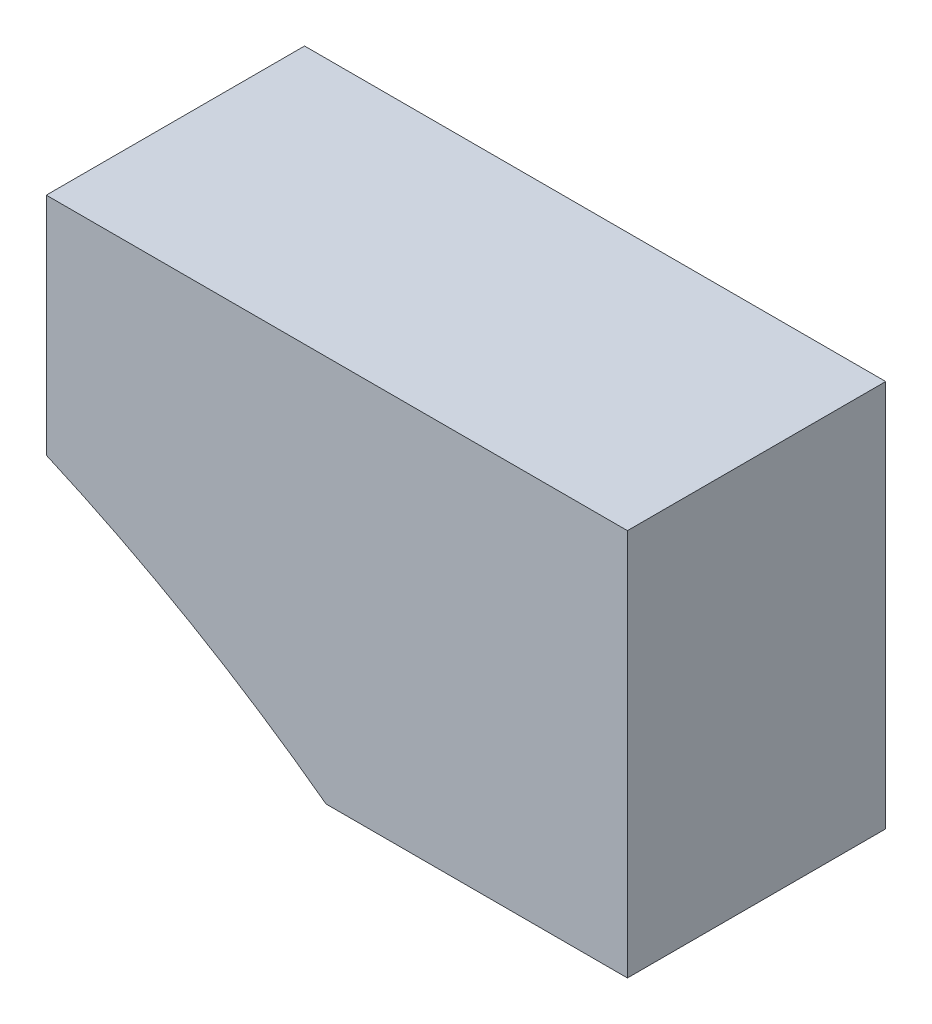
ISO-10303-21;
HEADER;
FILE_DESCRIPTION(('STEP AP214'),'2;1');
FILE_NAME('part.step','',(''),(''),'','','');
FILE_SCHEMA(('AUTOMOTIVE_DESIGN { 1 0 10303 214 1 1 1 1 }'));
ENDSEC;
DATA;
#1=APPLICATION_CONTEXT('core data for automotive mechanical design processes');
#2=APPLICATION_PROTOCOL_DEFINITION('international standard','automotive_design',2000,#1);
#3=PRODUCT_CONTEXT('',#1,'mechanical');
#4=PRODUCT('Part','Part','',(#3));
#5=PRODUCT_RELATED_PRODUCT_CATEGORY('part','',(#4));
#6=PRODUCT_DEFINITION_FORMATION('','',#4);
#7=PRODUCT_DEFINITION_CONTEXT('part definition',#1,'design');
#8=PRODUCT_DEFINITION('design','',#6,#7);
#9=PRODUCT_DEFINITION_SHAPE('','',#8);
#10=(LENGTH_UNIT() NAMED_UNIT(*) SI_UNIT(.MILLI.,.METRE.));
#11=(NAMED_UNIT(*) PLANE_ANGLE_UNIT() SI_UNIT($,.RADIAN.));
#12=(NAMED_UNIT(*) SI_UNIT($,.STERADIAN.) SOLID_ANGLE_UNIT());
#13=UNCERTAINTY_MEASURE_WITH_UNIT(LENGTH_MEASURE(1.E-05),#10,'distance_accuracy_value','');
#14=(GEOMETRIC_REPRESENTATION_CONTEXT(3) GLOBAL_UNCERTAINTY_ASSIGNED_CONTEXT((#13)) GLOBAL_UNIT_ASSIGNED_CONTEXT((#10,
#11,#12)) REPRESENTATION_CONTEXT('',''));
#15=CARTESIAN_POINT('',(0.,0.,0.));
#16=DIRECTION('',(0.,0.,1.));
#17=DIRECTION('',(1.,0.,0.));
#18=AXIS2_PLACEMENT_3D('',#15,#16,#17);
#19=CARTESIAN_POINT('',(0.,0.,20.));
#20=DIRECTION('',(0.,0.,-1.));
#21=DIRECTION('',(-1.,0.,0.));
#22=AXIS2_PLACEMENT_3D('',#19,#20,#21);
#23=CYLINDRICAL_SURFACE('',#22,112.);
#24=CARTESIAN_POINT('',(0.,0.,0.));
#25=DIRECTION('',(0.,0.,-1.));
#26=DIRECTION('',(1.,0.,0.));
#27=AXIS2_PLACEMENT_3D('',#24,#25,#26);
#28=CIRCLE('',#27,112.);
#29=CARTESIAN_POINT('',(45.,102.562176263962,0.));
#30=VERTEX_POINT('',#29);
#31=CARTESIAN_POINT('',(66.6633332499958,90.,0.));
#32=VERTEX_POINT('',#31);
#33=EDGE_CURVE('E76',#30,#32,#28,.T.);
#34=ORIENTED_EDGE('',*,*,#33,.T.);
#35=DIRECTION('',(0.,0.,-1.));
#36=VECTOR('',#35,1.);
#37=CARTESIAN_POINT('',(66.6633332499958,90.,20.));
#38=LINE('',#37,#36);
#39=CARTESIAN_POINT('',(66.6633332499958,90.,20.));
#40=VERTEX_POINT('',#39);
#41=EDGE_CURVE('E11',#40,#32,#38,.T.);
#42=ORIENTED_EDGE('',*,*,#41,.F.);
#43=CARTESIAN_POINT('',(0.,0.,20.));
#44=DIRECTION('',(0.,0.,-1.));
#45=DIRECTION('',(1.,0.,0.));
#46=AXIS2_PLACEMENT_3D('',#43,#44,#45);
#47=CIRCLE('',#46,112.);
#48=CARTESIAN_POINT('',(45.,102.562176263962,20.));
#49=VERTEX_POINT('',#48);
#50=EDGE_CURVE('E97',#49,#40,#47,.T.);
#51=ORIENTED_EDGE('',*,*,#50,.F.);
#52=DIRECTION('',(0.,0.,-1.));
#53=VECTOR('',#52,1.);
#54=CARTESIAN_POINT('',(45.,102.562176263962,20.));
#55=LINE('',#54,#53);
#56=EDGE_CURVE('E89',#49,#30,#55,.T.);
#57=ORIENTED_EDGE('',*,*,#56,.T.);
#58=EDGE_LOOP('',(#34,#42,#51,#57));
#59=FACE_BOUND('',#58,.T.);
#60=ADVANCED_FACE('F26',(#59),#23,.F.);
#61=CARTESIAN_POINT('',(66.6633332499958,90.,20.));
#62=DIRECTION('',(0.,1.,0.));
#63=DIRECTION('',(0.,0.,1.));
#64=AXIS2_PLACEMENT_3D('',#61,#62,#63);
#65=PLANE('',#64);
#66=DIRECTION('',(1.,0.,0.));
#67=VECTOR('',#66,1.);
#68=CARTESIAN_POINT('',(66.6633332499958,90.,0.));
#69=LINE('',#68,#67);
#70=CARTESIAN_POINT('',(90.,90.,0.));
#71=VERTEX_POINT('',#70);
#72=EDGE_CURVE('E72',#32,#71,#69,.T.);
#73=ORIENTED_EDGE('',*,*,#72,.T.);
#74=DIRECTION('',(0.,0.,-1.));
#75=VECTOR('',#74,1.);
#76=CARTESIAN_POINT('',(90.,90.,20.));
#77=LINE('',#76,#75);
#78=CARTESIAN_POINT('',(90.,90.,20.));
#79=VERTEX_POINT('',#78);
#80=EDGE_CURVE('E33',#79,#71,#77,.T.);
#81=ORIENTED_EDGE('',*,*,#80,.F.);
#82=DIRECTION('',(1.,0.,0.));
#83=VECTOR('',#82,1.);
#84=CARTESIAN_POINT('',(66.6633332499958,90.,20.));
#85=LINE('',#84,#83);
#86=EDGE_CURVE('E85',#40,#79,#85,.T.);
#87=ORIENTED_EDGE('',*,*,#86,.F.);
#88=ORIENTED_EDGE('',*,*,#41,.T.);
#89=EDGE_LOOP('',(#73,#81,#87,#88));
#90=FACE_BOUND('',#89,.T.);
#91=ADVANCED_FACE('F84',(#90),#65,.F.);
#92=CARTESIAN_POINT('',(90.,90.,20.));
#93=DIRECTION('',(-1.,0.,0.));
#94=DIRECTION('',(0.,0.,1.));
#95=AXIS2_PLACEMENT_3D('',#92,#93,#94);
#96=PLANE('',#95);
#97=DIRECTION('',(0.,1.,0.));
#98=VECTOR('',#97,1.);
#99=CARTESIAN_POINT('',(90.,90.,0.));
#100=LINE('',#99,#98);
#101=CARTESIAN_POINT('',(90.,120.,0.));
#102=VERTEX_POINT('',#101);
#103=EDGE_CURVE('E78',#71,#102,#100,.T.);
#104=ORIENTED_EDGE('',*,*,#103,.T.);
#105=DIRECTION('',(0.,0.,-1.));
#106=VECTOR('',#105,1.);
#107=CARTESIAN_POINT('',(90.,120.,20.));
#108=LINE('',#107,#106);
#109=CARTESIAN_POINT('',(90.,120.,20.));
#110=VERTEX_POINT('',#109);
#111=EDGE_CURVE('E108',#110,#102,#108,.T.);
#112=ORIENTED_EDGE('',*,*,#111,.F.);
#113=DIRECTION('',(0.,1.,0.));
#114=VECTOR('',#113,1.);
#115=CARTESIAN_POINT('',(90.,90.,20.));
#116=LINE('',#115,#114);
#117=EDGE_CURVE('E100',#79,#110,#116,.T.);
#118=ORIENTED_EDGE('',*,*,#117,.F.);
#119=ORIENTED_EDGE('',*,*,#80,.T.);
#120=EDGE_LOOP('',(#104,#112,#118,#119));
#121=FACE_BOUND('',#120,.T.);
#122=ADVANCED_FACE('F112',(#121),#96,.F.);
#123=CARTESIAN_POINT('',(90.,120.,20.));
#124=DIRECTION('',(0.,-1.,0.));
#125=DIRECTION('',(1.,0.,0.));
#126=AXIS2_PLACEMENT_3D('',#123,#124,#125);
#127=PLANE('',#126);
#128=DIRECTION('',(-1.,0.,0.));
#129=VECTOR('',#128,1.);
#130=CARTESIAN_POINT('',(90.,120.,0.));
#131=LINE('',#130,#129);
#132=CARTESIAN_POINT('',(45.,120.,0.));
#133=VERTEX_POINT('',#132);
#134=EDGE_CURVE('E93',#102,#133,#131,.T.);
#135=ORIENTED_EDGE('',*,*,#134,.T.);
#136=DIRECTION('',(0.,0.,-1.));
#137=VECTOR('',#136,1.);
#138=CARTESIAN_POINT('',(45.,120.,20.));
#139=LINE('',#138,#137);
#140=CARTESIAN_POINT('',(45.,120.,20.));
#141=VERTEX_POINT('',#140);
#142=EDGE_CURVE('E105',#141,#133,#139,.T.);
#143=ORIENTED_EDGE('',*,*,#142,.F.);
#144=DIRECTION('',(-1.,0.,0.));
#145=VECTOR('',#144,1.);
#146=CARTESIAN_POINT('',(90.,120.,20.));
#147=LINE('',#146,#145);
#148=EDGE_CURVE('E45',#110,#141,#147,.T.);
#149=ORIENTED_EDGE('',*,*,#148,.F.);
#150=ORIENTED_EDGE('',*,*,#111,.T.);
#151=EDGE_LOOP('',(#135,#143,#149,#150));
#152=FACE_BOUND('',#151,.T.);
#153=ADVANCED_FACE('F123',(#152),#127,.F.);
#154=CARTESIAN_POINT('',(45.,120.,20.));
#155=DIRECTION('',(1.,0.,0.));
#156=DIRECTION('',(0.,1.,0.));
#157=AXIS2_PLACEMENT_3D('',#154,#155,#156);
#158=PLANE('',#157);
#159=DIRECTION('',(0.,-1.,0.));
#160=VECTOR('',#159,1.);
#161=CARTESIAN_POINT('',(45.,120.,0.));
#162=LINE('',#161,#160);
#163=EDGE_CURVE('E95',#133,#30,#162,.T.);
#164=ORIENTED_EDGE('',*,*,#163,.T.);
#165=ORIENTED_EDGE('',*,*,#56,.F.);
#166=DIRECTION('',(0.,-1.,0.));
#167=VECTOR('',#166,1.);
#168=CARTESIAN_POINT('',(45.,120.,20.));
#169=LINE('',#168,#167);
#170=EDGE_CURVE('E40',#141,#49,#169,.T.);
#171=ORIENTED_EDGE('',*,*,#170,.F.);
#172=ORIENTED_EDGE('',*,*,#142,.T.);
#173=EDGE_LOOP('',(#164,#165,#171,#172));
#174=FACE_BOUND('',#173,.T.);
#175=ADVANCED_FACE('F116',(#174),#158,.F.);
#176=CARTESIAN_POINT('',(0.,0.,20.));
#177=DIRECTION('',(0.,0.,1.));
#178=DIRECTION('',(1.,0.,0.));
#179=AXIS2_PLACEMENT_3D('',#176,#177,#178);
#180=PLANE('',#179);
#181=ORIENTED_EDGE('',*,*,#50,.T.);
#182=ORIENTED_EDGE('',*,*,#86,.T.);
#183=ORIENTED_EDGE('',*,*,#117,.T.);
#184=ORIENTED_EDGE('',*,*,#148,.T.);
#185=ORIENTED_EDGE('',*,*,#170,.T.);
#186=EDGE_LOOP('',(#181,#182,#183,#184,#185));
#187=FACE_BOUND('',#186,.T.);
#188=ADVANCED_FACE('F114',(#187),#180,.T.);
#189=CARTESIAN_POINT('',(0.,0.,0.));
#190=DIRECTION('',(0.,0.,1.));
#191=DIRECTION('',(1.,0.,0.));
#192=AXIS2_PLACEMENT_3D('',#189,#190,#191);
#193=PLANE('',#192);
#194=ORIENTED_EDGE('',*,*,#33,.F.);
#195=ORIENTED_EDGE('',*,*,#163,.F.);
#196=ORIENTED_EDGE('',*,*,#134,.F.);
#197=ORIENTED_EDGE('',*,*,#103,.F.);
#198=ORIENTED_EDGE('',*,*,#72,.F.);
#199=EDGE_LOOP('',(#194,#195,#196,#197,#198));
#200=FACE_BOUND('',#199,.T.);
#201=ADVANCED_FACE('F73',(#200),#193,.F.);
#202=CLOSED_SHELL('',(#60,#91,#122,#153,#175,#188,#201));
#203=MANIFOLD_SOLID_BREP('B2',#202);
#204=ADVANCED_BREP_SHAPE_REPRESENTATION('',(#18,#203),#14);
#205=SHAPE_DEFINITION_REPRESENTATION(#9,#204);
ENDSEC;
END-ISO-10303-21;
